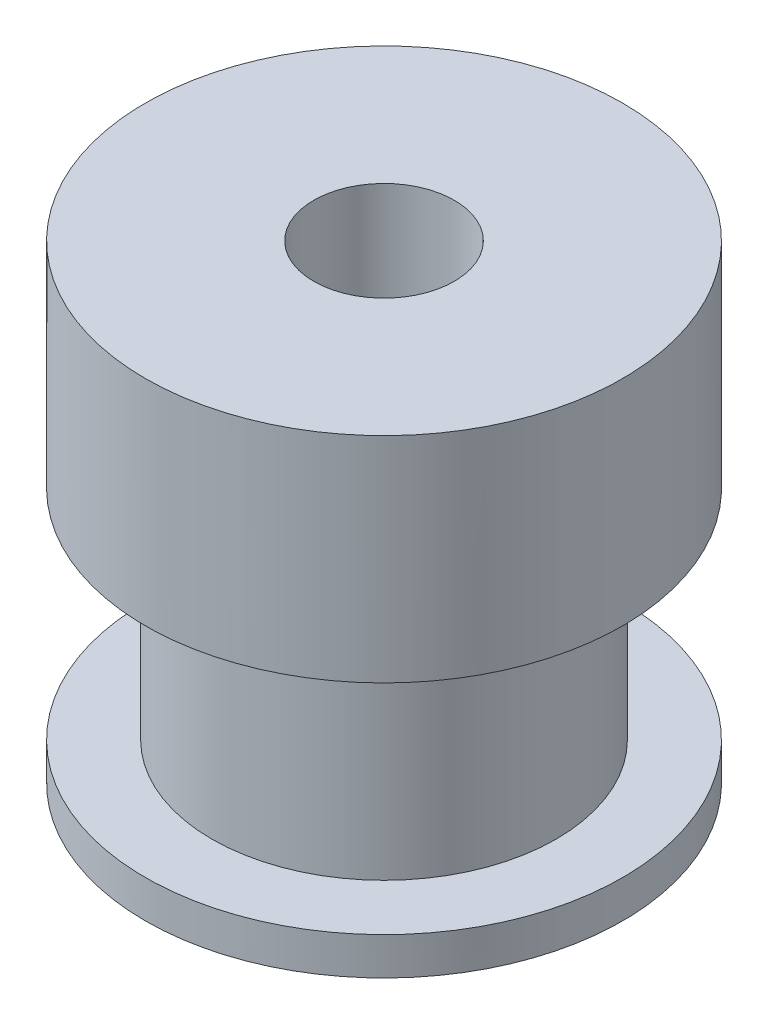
from build123d import *

# Parameters (mm, degrees)
SKETCH1_R           = 8.0645
BOSS_EXTRUDE1_DEPTH = 15.875
SKETCH2_W           = 2.2479
SKETCH2_H           = 7.366
SKETCH3_R           = 2.3749
CUT_EXTRUDE1_DEPTH  = 20.547069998


with BuildPart() as part:
    # Sketch1 → Boss-Extrude1 (new body)
    with BuildSketch(Plane(origin=(0, 0, 0), x_dir=(1, 0, 0), z_dir=(0, 1, 0))):
        with Locations(Location((0, 0, 0), (0, 0, 270))):
            Circle(SKETCH1_R)
    extrude(amount=BOSS_EXTRUDE1_DEPTH)

    # Sketch2 → Cut-Revolve1 (revolve, cut)
    with BuildSketch(Plane(origin=(0, 0, 0), x_dir=(0, 0, -1), z_dir=(1, 0, 0)), mode=Mode.PRIVATE) as cut_revolve1_sk:
        with Locations((-6.94055, 4.953)):
            Rectangle(SKETCH2_W, SKETCH2_H)
    revolve(cut_revolve1_sk.sketch.rotate(Axis((0, 0, 0), (0, 1, 0)), 180), axis=Axis((0, 0, 0), (0, 1, 0)), mode=Mode.SUBTRACT)

    # Sketch3 → Cut-Extrude1 (cut, through all)
    with BuildSketch(Plane(origin=(0, 15.875, 0), x_dir=(1, 0, 0), z_dir=(0, 1, 0))):
        with Locations(Location((0, 0, 0), (0, 0, 270))):
            Circle(SKETCH3_R)
    extrude(amount=-CUT_EXTRUDE1_DEPTH, mode=Mode.SUBTRACT)


solid = part.part
